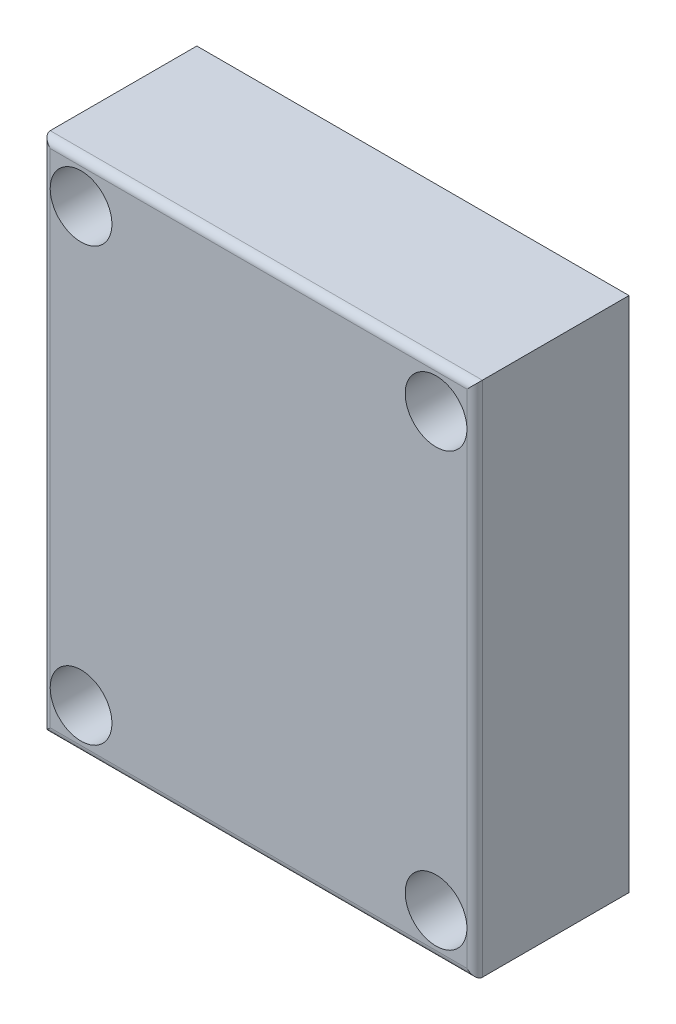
ISO-10303-21;
HEADER;
FILE_DESCRIPTION(('STEP AP214'),'2;1');
FILE_NAME('part.step','',(''),(''),'','','');
FILE_SCHEMA(('AUTOMOTIVE_DESIGN { 1 0 10303 214 1 1 1 1 }'));
ENDSEC;
DATA;
#1=APPLICATION_CONTEXT('core data for automotive mechanical design processes');
#2=APPLICATION_PROTOCOL_DEFINITION('international standard','automotive_design',2000,#1);
#3=PRODUCT_CONTEXT('',#1,'mechanical');
#4=PRODUCT('Part','Part','',(#3));
#5=PRODUCT_RELATED_PRODUCT_CATEGORY('part','',(#4));
#6=PRODUCT_DEFINITION_FORMATION('','',#4);
#7=PRODUCT_DEFINITION_CONTEXT('part definition',#1,'design');
#8=PRODUCT_DEFINITION('design','',#6,#7);
#9=PRODUCT_DEFINITION_SHAPE('','',#8);
#10=(LENGTH_UNIT() NAMED_UNIT(*) SI_UNIT(.MILLI.,.METRE.));
#11=(NAMED_UNIT(*) PLANE_ANGLE_UNIT() SI_UNIT($,.RADIAN.));
#12=(NAMED_UNIT(*) SI_UNIT($,.STERADIAN.) SOLID_ANGLE_UNIT());
#13=UNCERTAINTY_MEASURE_WITH_UNIT(LENGTH_MEASURE(1.E-05),#10,'distance_accuracy_value','');
#14=(GEOMETRIC_REPRESENTATION_CONTEXT(3) GLOBAL_UNCERTAINTY_ASSIGNED_CONTEXT((#13)) GLOBAL_UNIT_ASSIGNED_CONTEXT((#10,
#11,#12)) REPRESENTATION_CONTEXT('',''));
#15=CARTESIAN_POINT('',(0.,0.,0.));
#16=DIRECTION('',(0.,0.,1.));
#17=DIRECTION('',(1.,0.,0.));
#18=AXIS2_PLACEMENT_3D('',#15,#16,#17);
#19=CARTESIAN_POINT('',(11.5,14.,10.));
#20=DIRECTION('',(0.,0.,-1.));
#21=DIRECTION('',(-1.,0.,0.));
#22=AXIS2_PLACEMENT_3D('',#19,#20,#21);
#23=CYLINDRICAL_SURFACE('',#22,1.25);
#24=CARTESIAN_POINT('',(11.5,14.,0.));
#25=DIRECTION('',(0.,0.,1.));
#26=DIRECTION('',(1.,0.,0.));
#27=AXIS2_PLACEMENT_3D('',#24,#25,#26);
#28=CIRCLE('',#27,1.25);
#29=CARTESIAN_POINT('',(12.75,14.,0.));
#30=VERTEX_POINT('',#29);
#31=EDGE_CURVE('E151',#30,#30,#28,.T.);
#32=ORIENTED_EDGE('',*,*,#31,.F.);
#33=EDGE_LOOP('',(#32));
#34=FACE_BOUND('',#33,.T.);
#35=CARTESIAN_POINT('',(11.5,14.,7.));
#36=DIRECTION('',(0.,0.,1.));
#37=DIRECTION('',(1.,0.,0.));
#38=AXIS2_PLACEMENT_3D('',#35,#36,#37);
#39=CIRCLE('',#38,1.25);
#40=CARTESIAN_POINT('',(12.75,14.,7.));
#41=VERTEX_POINT('',#40);
#42=EDGE_CURVE('E150',#41,#41,#39,.T.);
#43=ORIENTED_EDGE('',*,*,#42,.T.);
#44=EDGE_LOOP('',(#43));
#45=FACE_BOUND('',#44,.T.);
#46=ADVANCED_FACE('F32',(#34,#45),#23,.F.);
#47=CARTESIAN_POINT('',(0.,0.,10.));
#48=DIRECTION('',(0.,0.,1.));
#49=DIRECTION('',(1.,0.,0.));
#50=AXIS2_PLACEMENT_3D('',#47,#48,#49);
#51=PLANE('',#50);
#52=DIRECTION('',(0.,-1.,0.));
#53=VECTOR('',#52,1.);
#54=CARTESIAN_POINT('',(-13.5,0.,10.));
#55=LINE('',#54,#53);
#56=CARTESIAN_POINT('',(-13.5,-14.,10.));
#57=VERTEX_POINT('',#56);
#58=CARTESIAN_POINT('',(-13.5,-16.25,10.));
#59=VERTEX_POINT('',#58);
#60=EDGE_CURVE('E159',#57,#59,#55,.T.);
#61=ORIENTED_EDGE('',*,*,#60,.T.);
#62=DIRECTION('',(1.,0.,0.));
#63=VECTOR('',#62,1.);
#64=CARTESIAN_POINT('',(0.,-16.25,10.));
#65=LINE('',#64,#63);
#66=CARTESIAN_POINT('',(13.5,-16.25,10.));
#67=VERTEX_POINT('',#66);
#68=EDGE_CURVE('E175',#59,#67,#65,.T.);
#69=ORIENTED_EDGE('',*,*,#68,.T.);
#70=DIRECTION('',(0.,-1.,0.));
#71=VECTOR('',#70,1.);
#72=CARTESIAN_POINT('',(13.5,0.,10.));
#73=LINE('',#72,#71);
#74=CARTESIAN_POINT('',(13.5,-14.,10.));
#75=VERTEX_POINT('',#74);
#76=EDGE_CURVE('E173',#67,#75,#73,.F.);
#77=ORIENTED_EDGE('',*,*,#76,.T.);
#78=CARTESIAN_POINT('',(11.5,-14.,10.));
#79=DIRECTION('',(0.,0.,-1.));
#80=DIRECTION('',(1.,0.,0.));
#81=AXIS2_PLACEMENT_3D('',#78,#79,#80);
#82=CIRCLE('',#81,2.);
#83=EDGE_CURVE('E123',#75,#75,#82,.T.);
#84=ORIENTED_EDGE('',*,*,#83,.T.);
#85=DIRECTION('',(0.,-1.,0.));
#86=VECTOR('',#85,1.);
#87=CARTESIAN_POINT('',(13.5,0.,10.));
#88=LINE('',#87,#86);
#89=CARTESIAN_POINT('',(13.5,14.,10.));
#90=VERTEX_POINT('',#89);
#91=EDGE_CURVE('E171',#75,#90,#88,.F.);
#92=ORIENTED_EDGE('',*,*,#91,.T.);
#93=CARTESIAN_POINT('',(11.5,14.,10.));
#94=DIRECTION('',(0.,0.,1.));
#95=DIRECTION('',(1.,0.,0.));
#96=AXIS2_PLACEMENT_3D('',#93,#94,#95);
#97=CIRCLE('',#96,2.);
#98=EDGE_CURVE('E142',#90,#90,#97,.T.);
#99=ORIENTED_EDGE('',*,*,#98,.F.);
#100=DIRECTION('',(0.,-1.,0.));
#101=VECTOR('',#100,1.);
#102=CARTESIAN_POINT('',(13.5,0.,10.));
#103=LINE('',#102,#101);
#104=CARTESIAN_POINT('',(13.5,16.25,10.));
#105=VERTEX_POINT('',#104);
#106=EDGE_CURVE('E169',#90,#105,#103,.F.);
#107=ORIENTED_EDGE('',*,*,#106,.T.);
#108=DIRECTION('',(1.,0.,0.));
#109=VECTOR('',#108,1.);
#110=CARTESIAN_POINT('',(0.,16.25,10.));
#111=LINE('',#110,#109);
#112=CARTESIAN_POINT('',(-13.5,16.25,10.));
#113=VERTEX_POINT('',#112);
#114=EDGE_CURVE('E167',#105,#113,#111,.F.);
#115=ORIENTED_EDGE('',*,*,#114,.T.);
#116=DIRECTION('',(0.,-1.,0.));
#117=VECTOR('',#116,1.);
#118=CARTESIAN_POINT('',(-13.5,0.,10.));
#119=LINE('',#118,#117);
#120=CARTESIAN_POINT('',(-13.5,14.,10.));
#121=VERTEX_POINT('',#120);
#122=EDGE_CURVE('E165',#113,#121,#119,.T.);
#123=ORIENTED_EDGE('',*,*,#122,.T.);
#124=CARTESIAN_POINT('',(-11.5,14.,10.));
#125=DIRECTION('',(0.,0.,-1.));
#126=DIRECTION('',(-1.,0.,0.));
#127=AXIS2_PLACEMENT_3D('',#124,#125,#126);
#128=CIRCLE('',#127,2.);
#129=EDGE_CURVE('E103',#121,#121,#128,.T.);
#130=ORIENTED_EDGE('',*,*,#129,.T.);
#131=DIRECTION('',(0.,-1.,0.));
#132=VECTOR('',#131,1.);
#133=CARTESIAN_POINT('',(-13.5,0.,10.));
#134=LINE('',#133,#132);
#135=EDGE_CURVE('E163',#121,#57,#134,.T.);
#136=ORIENTED_EDGE('',*,*,#135,.T.);
#137=CARTESIAN_POINT('',(-11.5,-14.,10.));
#138=DIRECTION('',(0.,0.,1.));
#139=DIRECTION('',(-1.,0.,0.));
#140=AXIS2_PLACEMENT_3D('',#137,#138,#139);
#141=CIRCLE('',#140,2.);
#142=EDGE_CURVE('E203',#57,#57,#141,.T.);
#143=ORIENTED_EDGE('',*,*,#142,.F.);
#144=EDGE_LOOP('',(#61,#69,#77,#84,#92,#99,#107,#115,#123,#130,#136,#143));
#145=FACE_BOUND('',#144,.T.);
#146=ADVANCED_FACE('F239',(#145),#51,.T.);
#147=CARTESIAN_POINT('',(0.,0.,0.));
#148=DIRECTION('',(0.,0.,1.));
#149=DIRECTION('',(1.,0.,0.));
#150=AXIS2_PLACEMENT_3D('',#147,#148,#149);
#151=PLANE('',#150);
#152=DIRECTION('',(1.,0.,0.));
#153=VECTOR('',#152,1.);
#154=CARTESIAN_POINT('',(0.,-16.75,0.));
#155=LINE('',#154,#153);
#156=CARTESIAN_POINT('',(-14.,-16.75,0.));
#157=VERTEX_POINT('',#156);
#158=CARTESIAN_POINT('',(14.,-16.75,0.));
#159=VERTEX_POINT('',#158);
#160=EDGE_CURVE('E99',#157,#159,#155,.T.);
#161=ORIENTED_EDGE('',*,*,#160,.F.);
#162=DIRECTION('',(0.,-1.,0.));
#163=VECTOR('',#162,1.);
#164=CARTESIAN_POINT('',(-14.,16.75,0.));
#165=LINE('',#164,#163);
#166=CARTESIAN_POINT('',(-14.,16.75,0.));
#167=VERTEX_POINT('',#166);
#168=EDGE_CURVE('E112',#167,#157,#165,.T.);
#169=ORIENTED_EDGE('',*,*,#168,.F.);
#170=DIRECTION('',(1.,0.,0.));
#171=VECTOR('',#170,1.);
#172=CARTESIAN_POINT('',(0.,16.75,0.));
#173=LINE('',#172,#171);
#174=CARTESIAN_POINT('',(14.,16.75,0.));
#175=VERTEX_POINT('',#174);
#176=EDGE_CURVE('E155',#167,#175,#173,.T.);
#177=ORIENTED_EDGE('',*,*,#176,.T.);
#178=DIRECTION('',(0.,-1.,0.));
#179=VECTOR('',#178,1.);
#180=CARTESIAN_POINT('',(14.,16.75,0.));
#181=LINE('',#180,#179);
#182=EDGE_CURVE('E114',#175,#159,#181,.T.);
#183=ORIENTED_EDGE('',*,*,#182,.T.);
#184=EDGE_LOOP('',(#161,#169,#177,#183));
#185=FACE_BOUND('',#184,.T.);
#186=ORIENTED_EDGE('',*,*,#31,.T.);
#187=EDGE_LOOP('',(#186));
#188=FACE_BOUND('',#187,.T.);
#189=CARTESIAN_POINT('',(11.5,-14.,0.));
#190=DIRECTION('',(0.,0.,-1.));
#191=DIRECTION('',(1.,0.,0.));
#192=AXIS2_PLACEMENT_3D('',#189,#190,#191);
#193=CIRCLE('',#192,1.25);
#194=CARTESIAN_POINT('',(12.75,-14.,0.));
#195=VERTEX_POINT('',#194);
#196=EDGE_CURVE('E116',#195,#195,#193,.T.);
#197=ORIENTED_EDGE('',*,*,#196,.F.);
#198=EDGE_LOOP('',(#197));
#199=FACE_BOUND('',#198,.T.);
#200=CARTESIAN_POINT('',(-11.5,14.,0.));
#201=DIRECTION('',(0.,0.,-1.));
#202=DIRECTION('',(-1.,0.,0.));
#203=AXIS2_PLACEMENT_3D('',#200,#201,#202);
#204=CIRCLE('',#203,1.25);
#205=CARTESIAN_POINT('',(-12.75,14.,0.));
#206=VERTEX_POINT('',#205);
#207=EDGE_CURVE('E121',#206,#206,#204,.T.);
#208=ORIENTED_EDGE('',*,*,#207,.F.);
#209=EDGE_LOOP('',(#208));
#210=FACE_BOUND('',#209,.T.);
#211=CARTESIAN_POINT('',(-11.5,-14.,0.));
#212=DIRECTION('',(0.,0.,1.));
#213=DIRECTION('',(-1.,0.,0.));
#214=AXIS2_PLACEMENT_3D('',#211,#212,#213);
#215=CIRCLE('',#214,1.25);
#216=CARTESIAN_POINT('',(-12.75,-14.,0.));
#217=VERTEX_POINT('',#216);
#218=EDGE_CURVE('E104',#217,#217,#215,.T.);
#219=ORIENTED_EDGE('',*,*,#218,.T.);
#220=EDGE_LOOP('',(#219));
#221=FACE_BOUND('',#220,.T.);
#222=ADVANCED_FACE('F109',(#185,#188,#199,#210,#221),#151,.F.);
#223=CARTESIAN_POINT('',(14.,16.75,10.));
#224=DIRECTION('',(1.,0.,0.));
#225=DIRECTION('',(0.,1.,0.));
#226=AXIS2_PLACEMENT_3D('',#223,#224,#225);
#227=PLANE('',#226);
#228=DIRECTION('',(0.,0.,-1.));
#229=VECTOR('',#228,1.);
#230=CARTESIAN_POINT('',(14.,16.75,10.));
#231=LINE('',#230,#229);
#232=CARTESIAN_POINT('',(14.,16.75,9.5));
#233=VERTEX_POINT('',#232);
#234=EDGE_CURVE('E157',#233,#175,#231,.T.);
#235=ORIENTED_EDGE('',*,*,#234,.F.);
#236=DIRECTION('',(0.,-1.,0.));
#237=VECTOR('',#236,1.);
#238=CARTESIAN_POINT('',(14.,16.75,9.5));
#239=LINE('',#238,#237);
#240=CARTESIAN_POINT('',(14.,-16.75,9.5));
#241=VERTEX_POINT('',#240);
#242=EDGE_CURVE('E179',#233,#241,#239,.T.);
#243=ORIENTED_EDGE('',*,*,#242,.T.);
#244=DIRECTION('',(0.,0.,-1.));
#245=VECTOR('',#244,1.);
#246=CARTESIAN_POINT('',(14.,-16.75,10.));
#247=LINE('',#246,#245);
#248=EDGE_CURVE('E115',#241,#159,#247,.T.);
#249=ORIENTED_EDGE('',*,*,#248,.T.);
#250=ORIENTED_EDGE('',*,*,#182,.F.);
#251=EDGE_LOOP('',(#235,#243,#249,#250));
#252=FACE_BOUND('',#251,.T.);
#253=ADVANCED_FACE('F34',(#252),#227,.T.);
#254=CARTESIAN_POINT('',(0.,16.75,10.));
#255=DIRECTION('',(0.,1.,0.));
#256=DIRECTION('',(0.,0.,1.));
#257=AXIS2_PLACEMENT_3D('',#254,#255,#256);
#258=PLANE('',#257);
#259=DIRECTION('',(0.,0.,-1.));
#260=VECTOR('',#259,1.);
#261=CARTESIAN_POINT('',(-14.,16.75,10.));
#262=LINE('',#261,#260);
#263=CARTESIAN_POINT('',(-14.,16.75,9.5));
#264=VERTEX_POINT('',#263);
#265=EDGE_CURVE('E119',#264,#167,#262,.T.);
#266=ORIENTED_EDGE('',*,*,#265,.F.);
#267=DIRECTION('',(1.,0.,0.));
#268=VECTOR('',#267,1.);
#269=CARTESIAN_POINT('',(0.,16.75,9.5));
#270=LINE('',#269,#268);
#271=EDGE_CURVE('E40',#264,#233,#270,.T.);
#272=ORIENTED_EDGE('',*,*,#271,.T.);
#273=ORIENTED_EDGE('',*,*,#234,.T.);
#274=ORIENTED_EDGE('',*,*,#176,.F.);
#275=EDGE_LOOP('',(#266,#272,#273,#274));
#276=FACE_BOUND('',#275,.T.);
#277=ADVANCED_FACE('F254',(#276),#258,.T.);
#278=CARTESIAN_POINT('',(11.5,14.,7.));
#279=DIRECTION('',(0.,0.,1.));
#280=DIRECTION('',(1.,0.,0.));
#281=AXIS2_PLACEMENT_3D('',#278,#279,#280);
#282=CYLINDRICAL_SURFACE('',#281,2.);
#283=CARTESIAN_POINT('',(11.5,14.,7.));
#284=DIRECTION('',(0.,0.,1.));
#285=DIRECTION('',(1.,0.,0.));
#286=AXIS2_PLACEMENT_3D('',#283,#284,#285);
#287=CIRCLE('',#286,2.);
#288=CARTESIAN_POINT('',(13.5,14.,7.));
#289=VERTEX_POINT('',#288);
#290=EDGE_CURVE('E147',#289,#289,#287,.T.);
#291=ORIENTED_EDGE('',*,*,#290,.F.);
#292=EDGE_LOOP('',(#291));
#293=FACE_BOUND('',#292,.T.);
#294=ORIENTED_EDGE('',*,*,#98,.T.);
#295=EDGE_LOOP('',(#294));
#296=FACE_BOUND('',#295,.T.);
#297=ADVANCED_FACE('F251',(#293,#296),#282,.F.);
#298=CARTESIAN_POINT('',(11.5,14.,7.));
#299=DIRECTION('',(0.,0.,1.));
#300=DIRECTION('',(1.,0.,0.));
#301=AXIS2_PLACEMENT_3D('',#298,#299,#300);
#302=PLANE('',#301);
#303=ORIENTED_EDGE('',*,*,#42,.F.);
#304=EDGE_LOOP('',(#303));
#305=FACE_BOUND('',#304,.T.);
#306=ORIENTED_EDGE('',*,*,#290,.T.);
#307=EDGE_LOOP('',(#306));
#308=FACE_BOUND('',#307,.T.);
#309=ADVANCED_FACE('F256',(#305,#308),#302,.T.);
#310=CARTESIAN_POINT('',(11.5,-14.,10.));
#311=DIRECTION('',(0.,0.,-1.));
#312=DIRECTION('',(-1.,0.,0.));
#313=AXIS2_PLACEMENT_3D('',#310,#311,#312);
#314=CYLINDRICAL_SURFACE('',#313,1.25);
#315=ORIENTED_EDGE('',*,*,#196,.T.);
#316=EDGE_LOOP('',(#315));
#317=FACE_BOUND('',#316,.T.);
#318=CARTESIAN_POINT('',(11.5,-14.,7.));
#319=DIRECTION('',(0.,0.,-1.));
#320=DIRECTION('',(1.,0.,0.));
#321=AXIS2_PLACEMENT_3D('',#318,#319,#320);
#322=CIRCLE('',#321,1.25);
#323=CARTESIAN_POINT('',(12.75,-14.,7.));
#324=VERTEX_POINT('',#323);
#325=EDGE_CURVE('E138',#324,#324,#322,.T.);
#326=ORIENTED_EDGE('',*,*,#325,.F.);
#327=EDGE_LOOP('',(#326));
#328=FACE_BOUND('',#327,.T.);
#329=ADVANCED_FACE('F262',(#317,#328),#314,.F.);
#330=CARTESIAN_POINT('',(0.,-16.75,10.));
#331=DIRECTION('',(0.,-1.,0.));
#332=DIRECTION('',(0.,0.,1.));
#333=AXIS2_PLACEMENT_3D('',#330,#331,#332);
#334=PLANE('',#333);
#335=ORIENTED_EDGE('',*,*,#248,.F.);
#336=DIRECTION('',(1.,0.,0.));
#337=VECTOR('',#336,1.);
#338=CARTESIAN_POINT('',(0.,-16.75,9.5));
#339=LINE('',#338,#337);
#340=CARTESIAN_POINT('',(-14.,-16.75,9.5));
#341=VERTEX_POINT('',#340);
#342=EDGE_CURVE('E101',#241,#341,#339,.F.);
#343=ORIENTED_EDGE('',*,*,#342,.T.);
#344=DIRECTION('',(0.,0.,-1.));
#345=VECTOR('',#344,1.);
#346=CARTESIAN_POINT('',(-14.,-16.75,10.));
#347=LINE('',#346,#345);
#348=EDGE_CURVE('E95',#341,#157,#347,.T.);
#349=ORIENTED_EDGE('',*,*,#348,.T.);
#350=ORIENTED_EDGE('',*,*,#160,.T.);
#351=EDGE_LOOP('',(#335,#343,#349,#350));
#352=FACE_BOUND('',#351,.T.);
#353=ADVANCED_FACE('F98',(#352),#334,.T.);
#354=CARTESIAN_POINT('',(11.5,-14.,7.));
#355=DIRECTION('',(0.,0.,1.));
#356=DIRECTION('',(1.,0.,0.));
#357=AXIS2_PLACEMENT_3D('',#354,#355,#356);
#358=CYLINDRICAL_SURFACE('',#357,2.);
#359=CARTESIAN_POINT('',(11.5,-14.,7.));
#360=DIRECTION('',(0.,0.,-1.));
#361=DIRECTION('',(1.,0.,0.));
#362=AXIS2_PLACEMENT_3D('',#359,#360,#361);
#363=CIRCLE('',#362,2.);
#364=CARTESIAN_POINT('',(13.5,-14.,7.));
#365=VERTEX_POINT('',#364);
#366=EDGE_CURVE('E135',#365,#365,#363,.T.);
#367=ORIENTED_EDGE('',*,*,#366,.T.);
#368=EDGE_LOOP('',(#367));
#369=FACE_BOUND('',#368,.T.);
#370=ORIENTED_EDGE('',*,*,#83,.F.);
#371=EDGE_LOOP('',(#370));
#372=FACE_BOUND('',#371,.T.);
#373=ADVANCED_FACE('F274',(#369,#372),#358,.F.);
#374=CARTESIAN_POINT('',(11.5,-14.,7.));
#375=DIRECTION('',(0.,0.,1.));
#376=DIRECTION('',(1.,0.,0.));
#377=AXIS2_PLACEMENT_3D('',#374,#375,#376);
#378=PLANE('',#377);
#379=ORIENTED_EDGE('',*,*,#325,.T.);
#380=EDGE_LOOP('',(#379));
#381=FACE_BOUND('',#380,.T.);
#382=ORIENTED_EDGE('',*,*,#366,.F.);
#383=EDGE_LOOP('',(#382));
#384=FACE_BOUND('',#383,.T.);
#385=ADVANCED_FACE('F275',(#381,#384),#378,.T.);
#386=CARTESIAN_POINT('',(-11.5,14.,10.));
#387=DIRECTION('',(0.,0.,-1.));
#388=DIRECTION('',(1.,0.,0.));
#389=AXIS2_PLACEMENT_3D('',#386,#387,#388);
#390=CYLINDRICAL_SURFACE('',#389,1.25);
#391=ORIENTED_EDGE('',*,*,#207,.T.);
#392=EDGE_LOOP('',(#391));
#393=FACE_BOUND('',#392,.T.);
#394=CARTESIAN_POINT('',(-11.5,14.,7.));
#395=DIRECTION('',(0.,0.,-1.));
#396=DIRECTION('',(-1.,0.,0.));
#397=AXIS2_PLACEMENT_3D('',#394,#395,#396);
#398=CIRCLE('',#397,1.25);
#399=CARTESIAN_POINT('',(-12.75,14.,7.));
#400=VERTEX_POINT('',#399);
#401=EDGE_CURVE('E126',#400,#400,#398,.T.);
#402=ORIENTED_EDGE('',*,*,#401,.F.);
#403=EDGE_LOOP('',(#402));
#404=FACE_BOUND('',#403,.T.);
#405=ADVANCED_FACE('F236',(#393,#404),#390,.F.);
#406=CARTESIAN_POINT('',(-14.,16.75,10.));
#407=DIRECTION('',(-1.,0.,0.));
#408=DIRECTION('',(0.,1.,0.));
#409=AXIS2_PLACEMENT_3D('',#406,#407,#408);
#410=PLANE('',#409);
#411=ORIENTED_EDGE('',*,*,#348,.F.);
#412=DIRECTION('',(0.,-1.,0.));
#413=VECTOR('',#412,1.);
#414=CARTESIAN_POINT('',(-14.,16.75,9.5));
#415=LINE('',#414,#413);
#416=EDGE_CURVE('E11',#341,#264,#415,.F.);
#417=ORIENTED_EDGE('',*,*,#416,.T.);
#418=ORIENTED_EDGE('',*,*,#265,.T.);
#419=ORIENTED_EDGE('',*,*,#168,.T.);
#420=EDGE_LOOP('',(#411,#417,#418,#419));
#421=FACE_BOUND('',#420,.T.);
#422=ADVANCED_FACE('F118',(#421),#410,.T.);
#423=CARTESIAN_POINT('',(-11.5,14.,7.));
#424=DIRECTION('',(0.,0.,1.));
#425=DIRECTION('',(-1.,0.,0.));
#426=AXIS2_PLACEMENT_3D('',#423,#424,#425);
#427=CYLINDRICAL_SURFACE('',#426,2.);
#428=CARTESIAN_POINT('',(-11.5,14.,7.));
#429=DIRECTION('',(0.,0.,-1.));
#430=DIRECTION('',(-1.,0.,0.));
#431=AXIS2_PLACEMENT_3D('',#428,#429,#430);
#432=CIRCLE('',#431,2.);
#433=CARTESIAN_POINT('',(-13.5,14.,7.));
#434=VERTEX_POINT('',#433);
#435=EDGE_CURVE('E132',#434,#434,#432,.T.);
#436=ORIENTED_EDGE('',*,*,#435,.T.);
#437=EDGE_LOOP('',(#436));
#438=FACE_BOUND('',#437,.T.);
#439=ORIENTED_EDGE('',*,*,#129,.F.);
#440=EDGE_LOOP('',(#439));
#441=FACE_BOUND('',#440,.T.);
#442=ADVANCED_FACE('F218',(#438,#441),#427,.F.);
#443=CARTESIAN_POINT('',(-11.5,14.,7.));
#444=DIRECTION('',(0.,0.,1.));
#445=DIRECTION('',(-1.,0.,0.));
#446=AXIS2_PLACEMENT_3D('',#443,#444,#445);
#447=PLANE('',#446);
#448=ORIENTED_EDGE('',*,*,#401,.T.);
#449=EDGE_LOOP('',(#448));
#450=FACE_BOUND('',#449,.T.);
#451=ORIENTED_EDGE('',*,*,#435,.F.);
#452=EDGE_LOOP('',(#451));
#453=FACE_BOUND('',#452,.T.);
#454=ADVANCED_FACE('F221',(#450,#453),#447,.T.);
#455=CARTESIAN_POINT('',(-11.5,-14.,10.));
#456=DIRECTION('',(0.,0.,-1.));
#457=DIRECTION('',(1.,0.,0.));
#458=AXIS2_PLACEMENT_3D('',#455,#456,#457);
#459=CYLINDRICAL_SURFACE('',#458,1.25);
#460=ORIENTED_EDGE('',*,*,#218,.F.);
#461=EDGE_LOOP('',(#460));
#462=FACE_BOUND('',#461,.T.);
#463=CARTESIAN_POINT('',(-11.5,-14.,7.));
#464=DIRECTION('',(0.,0.,1.));
#465=DIRECTION('',(-1.,0.,0.));
#466=AXIS2_PLACEMENT_3D('',#463,#464,#465);
#467=CIRCLE('',#466,1.25);
#468=CARTESIAN_POINT('',(-12.75,-14.,7.));
#469=VERTEX_POINT('',#468);
#470=EDGE_CURVE('E209',#469,#469,#467,.T.);
#471=ORIENTED_EDGE('',*,*,#470,.T.);
#472=EDGE_LOOP('',(#471));
#473=FACE_BOUND('',#472,.T.);
#474=ADVANCED_FACE('F223',(#462,#473),#459,.F.);
#475=CARTESIAN_POINT('',(-11.5,-14.,7.));
#476=DIRECTION('',(0.,0.,1.));
#477=DIRECTION('',(-1.,0.,0.));
#478=AXIS2_PLACEMENT_3D('',#475,#476,#477);
#479=CYLINDRICAL_SURFACE('',#478,2.);
#480=CARTESIAN_POINT('',(-11.5,-14.,7.));
#481=DIRECTION('',(0.,0.,1.));
#482=DIRECTION('',(-1.,0.,0.));
#483=AXIS2_PLACEMENT_3D('',#480,#481,#482);
#484=CIRCLE('',#483,2.);
#485=CARTESIAN_POINT('',(-13.5,-14.,7.));
#486=VERTEX_POINT('',#485);
#487=EDGE_CURVE('E206',#486,#486,#484,.T.);
#488=ORIENTED_EDGE('',*,*,#487,.F.);
#489=EDGE_LOOP('',(#488));
#490=FACE_BOUND('',#489,.T.);
#491=ORIENTED_EDGE('',*,*,#142,.T.);
#492=EDGE_LOOP('',(#491));
#493=FACE_BOUND('',#492,.T.);
#494=ADVANCED_FACE('F230',(#490,#493),#479,.F.);
#495=CARTESIAN_POINT('',(-11.5,-14.,7.));
#496=DIRECTION('',(0.,0.,1.));
#497=DIRECTION('',(-1.,0.,0.));
#498=AXIS2_PLACEMENT_3D('',#495,#496,#497);
#499=PLANE('',#498);
#500=ORIENTED_EDGE('',*,*,#470,.F.);
#501=EDGE_LOOP('',(#500));
#502=FACE_BOUND('',#501,.T.);
#503=ORIENTED_EDGE('',*,*,#487,.T.);
#504=EDGE_LOOP('',(#503));
#505=FACE_BOUND('',#504,.T.);
#506=ADVANCED_FACE('F233',(#502,#505),#499,.T.);
#507=CARTESIAN_POINT('',(0.,16.25,9.5));
#508=DIRECTION('',(1.,0.,0.));
#509=DIRECTION('',(0.,0.,-1.));
#510=AXIS2_PLACEMENT_3D('',#507,#508,#509);
#511=CYLINDRICAL_SURFACE('',#510,0.5);
#512=CARTESIAN_POINT('',(13.5,16.25,9.5));
#513=DIRECTION('',(0.707106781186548,-0.707106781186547,0.));
#514=DIRECTION('',(0.707106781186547,0.707106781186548,0.));
#515=AXIS2_PLACEMENT_3D('',#512,#513,#514);
#516=ELLIPSE('',#515,0.707106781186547,0.5);
#517=EDGE_CURVE('E196',#233,#105,#516,.T.);
#518=ORIENTED_EDGE('',*,*,#517,.F.);
#519=ORIENTED_EDGE('',*,*,#271,.F.);
#520=CARTESIAN_POINT('',(-13.5,16.25,9.5));
#521=DIRECTION('',(-0.707106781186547,-0.707106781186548,0.));
#522=DIRECTION('',(0.707106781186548,-0.707106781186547,0.));
#523=AXIS2_PLACEMENT_3D('',#520,#521,#522);
#524=ELLIPSE('',#523,0.707106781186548,0.5);
#525=EDGE_CURVE('E200',#113,#264,#524,.T.);
#526=ORIENTED_EDGE('',*,*,#525,.F.);
#527=ORIENTED_EDGE('',*,*,#114,.F.);
#528=EDGE_LOOP('',(#518,#519,#526,#527));
#529=FACE_BOUND('',#528,.T.);
#530=ADVANCED_FACE('F298',(#529),#511,.T.);
#531=CARTESIAN_POINT('',(-13.5,0.,9.5));
#532=DIRECTION('',(0.,-1.,0.));
#533=DIRECTION('',(1.,0.,0.));
#534=AXIS2_PLACEMENT_3D('',#531,#532,#533);
#535=CYLINDRICAL_SURFACE('',#534,0.5);
#536=ORIENTED_EDGE('',*,*,#525,.T.);
#537=ORIENTED_EDGE('',*,*,#416,.F.);
#538=CARTESIAN_POINT('',(-13.5,-16.25,9.5));
#539=DIRECTION('',(0.707106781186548,-0.707106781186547,0.));
#540=DIRECTION('',(-0.707106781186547,-0.707106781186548,0.));
#541=AXIS2_PLACEMENT_3D('',#538,#539,#540);
#542=ELLIPSE('',#541,0.707106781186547,0.5);
#543=EDGE_CURVE('E192',#59,#341,#542,.T.);
#544=ORIENTED_EDGE('',*,*,#543,.F.);
#545=ORIENTED_EDGE('',*,*,#60,.F.);
#546=ORIENTED_EDGE('',*,*,#135,.F.);
#547=ORIENTED_EDGE('',*,*,#122,.F.);
#548=EDGE_LOOP('',(#536,#537,#544,#545,#546,#547));
#549=FACE_BOUND('',#548,.T.);
#550=ADVANCED_FACE('F309',(#549),#535,.T.);
#551=CARTESIAN_POINT('',(13.5,16.75,9.5));
#552=DIRECTION('',(0.,-1.,0.));
#553=DIRECTION('',(1.,0.,0.));
#554=AXIS2_PLACEMENT_3D('',#551,#552,#553);
#555=CYLINDRICAL_SURFACE('',#554,0.5);
#556=ORIENTED_EDGE('',*,*,#91,.F.);
#557=ORIENTED_EDGE('',*,*,#76,.F.);
#558=CARTESIAN_POINT('',(13.5,-16.25,9.5));
#559=DIRECTION('',(-0.707106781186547,-0.707106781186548,0.));
#560=DIRECTION('',(0.707106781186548,-0.707106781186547,0.));
#561=AXIS2_PLACEMENT_3D('',#558,#559,#560);
#562=ELLIPSE('',#561,0.707106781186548,0.5);
#563=EDGE_CURVE('E189',#241,#67,#562,.T.);
#564=ORIENTED_EDGE('',*,*,#563,.F.);
#565=ORIENTED_EDGE('',*,*,#242,.F.);
#566=ORIENTED_EDGE('',*,*,#517,.T.);
#567=ORIENTED_EDGE('',*,*,#106,.F.);
#568=EDGE_LOOP('',(#556,#557,#564,#565,#566,#567));
#569=FACE_BOUND('',#568,.T.);
#570=ADVANCED_FACE('F194',(#569),#555,.T.);
#571=CARTESIAN_POINT('',(0.,-16.25,9.5));
#572=DIRECTION('',(1.,0.,0.));
#573=DIRECTION('',(0.,0.,-1.));
#574=AXIS2_PLACEMENT_3D('',#571,#572,#573);
#575=CYLINDRICAL_SURFACE('',#574,0.5);
#576=ORIENTED_EDGE('',*,*,#543,.T.);
#577=ORIENTED_EDGE('',*,*,#342,.F.);
#578=ORIENTED_EDGE('',*,*,#563,.T.);
#579=ORIENTED_EDGE('',*,*,#68,.F.);
#580=EDGE_LOOP('',(#576,#577,#578,#579));
#581=FACE_BOUND('',#580,.T.);
#582=ADVANCED_FACE('F187',(#581),#575,.T.);
#583=CLOSED_SHELL('',(#46,#146,#222,#253,#277,#297,#309,#329,#353,#373,#385,#405,#422,#442,#454,
#474,#494,#506,#530,#550,#570,#582));
#584=MANIFOLD_SOLID_BREP('B2',#583);
#585=ADVANCED_BREP_SHAPE_REPRESENTATION('',(#18,#584),#14);
#586=SHAPE_DEFINITION_REPRESENTATION(#9,#585);
ENDSEC;
END-ISO-10303-21;
